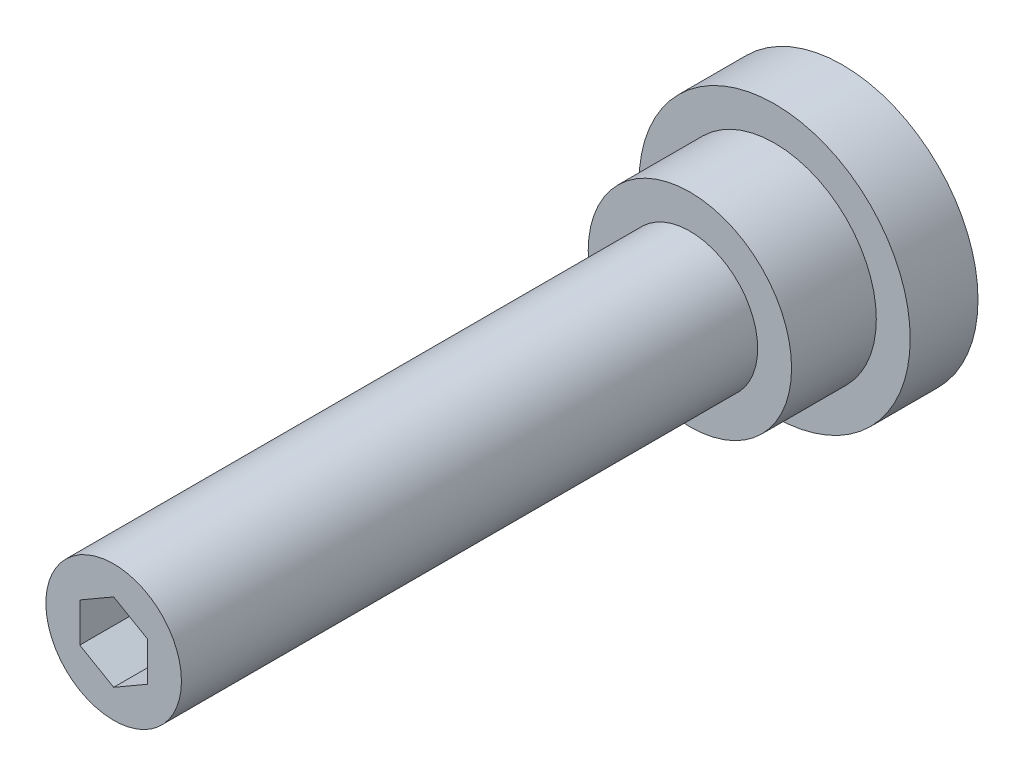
ISO-10303-21;
HEADER;
FILE_DESCRIPTION(('STEP AP214'),'2;1');
FILE_NAME('part.step','',(''),(''),'','','');
FILE_SCHEMA(('AUTOMOTIVE_DESIGN { 1 0 10303 214 1 1 1 1 }'));
ENDSEC;
DATA;
#1=APPLICATION_CONTEXT('core data for automotive mechanical design processes');
#2=APPLICATION_PROTOCOL_DEFINITION('international standard','automotive_design',2000,#1);
#3=PRODUCT_CONTEXT('',#1,'mechanical');
#4=PRODUCT('Part','Part','',(#3));
#5=PRODUCT_RELATED_PRODUCT_CATEGORY('part','',(#4));
#6=PRODUCT_DEFINITION_FORMATION('','',#4);
#7=PRODUCT_DEFINITION_CONTEXT('part definition',#1,'design');
#8=PRODUCT_DEFINITION('design','',#6,#7);
#9=PRODUCT_DEFINITION_SHAPE('','',#8);
#10=(LENGTH_UNIT() NAMED_UNIT(*) SI_UNIT(.MILLI.,.METRE.));
#11=(NAMED_UNIT(*) PLANE_ANGLE_UNIT() SI_UNIT($,.RADIAN.));
#12=(NAMED_UNIT(*) SI_UNIT($,.STERADIAN.) SOLID_ANGLE_UNIT());
#13=UNCERTAINTY_MEASURE_WITH_UNIT(LENGTH_MEASURE(1.E-05),#10,'distance_accuracy_value','');
#14=(GEOMETRIC_REPRESENTATION_CONTEXT(3) GLOBAL_UNCERTAINTY_ASSIGNED_CONTEXT((#13)) GLOBAL_UNIT_ASSIGNED_CONTEXT((#10,
#11,#12)) REPRESENTATION_CONTEXT('',''));
#15=CARTESIAN_POINT('',(0.,0.,0.));
#16=DIRECTION('',(0.,0.,1.));
#17=DIRECTION('',(1.,0.,0.));
#18=AXIS2_PLACEMENT_3D('',#15,#16,#17);
#19=CARTESIAN_POINT('',(0.,0.,43.));
#20=DIRECTION('',(0.,0.,1.));
#21=DIRECTION('',(1.,0.,0.));
#22=AXIS2_PLACEMENT_3D('',#19,#20,#21);
#23=PLANE('',#22);
#24=DIRECTION('',(-0.866025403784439,0.5,0.));
#25=VECTOR('',#24,1.);
#26=CARTESIAN_POINT('',(2.,1.15470053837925,43.));
#27=LINE('',#26,#25);
#28=CARTESIAN_POINT('',(2.,1.15470053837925,43.));
#29=VERTEX_POINT('',#28);
#30=CARTESIAN_POINT('',(0.,2.30940107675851,43.));
#31=VERTEX_POINT('',#30);
#32=EDGE_CURVE('E28',#29,#31,#27,.T.);
#33=ORIENTED_EDGE('',*,*,#32,.F.);
#34=DIRECTION('',(0.,1.,0.));
#35=VECTOR('',#34,1.);
#36=CARTESIAN_POINT('',(2.,-1.15470053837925,43.));
#37=LINE('',#36,#35);
#38=CARTESIAN_POINT('',(2.,-1.15470053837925,43.));
#39=VERTEX_POINT('',#38);
#40=EDGE_CURVE('E111',#39,#29,#37,.T.);
#41=ORIENTED_EDGE('',*,*,#40,.F.);
#42=DIRECTION('',(0.866025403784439,0.5,0.));
#43=VECTOR('',#42,1.);
#44=CARTESIAN_POINT('',(0.,-2.30940107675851,43.));
#45=LINE('',#44,#43);
#46=CARTESIAN_POINT('',(0.,-2.30940107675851,43.));
#47=VERTEX_POINT('',#46);
#48=EDGE_CURVE('E109',#47,#39,#45,.T.);
#49=ORIENTED_EDGE('',*,*,#48,.F.);
#50=DIRECTION('',(0.866025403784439,-0.5,0.));
#51=VECTOR('',#50,1.);
#52=CARTESIAN_POINT('',(-2.,-1.15470053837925,43.));
#53=LINE('',#52,#51);
#54=CARTESIAN_POINT('',(-2.,-1.15470053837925,43.));
#55=VERTEX_POINT('',#54);
#56=EDGE_CURVE('E76',#55,#47,#53,.T.);
#57=ORIENTED_EDGE('',*,*,#56,.F.);
#58=DIRECTION('',(0.,-1.,0.));
#59=VECTOR('',#58,1.);
#60=CARTESIAN_POINT('',(-2.,1.15470053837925,43.));
#61=LINE('',#60,#59);
#62=CARTESIAN_POINT('',(-2.,1.15470053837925,43.));
#63=VERTEX_POINT('',#62);
#64=EDGE_CURVE('E105',#63,#55,#61,.T.);
#65=ORIENTED_EDGE('',*,*,#64,.F.);
#66=DIRECTION('',(-0.866025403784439,-0.5,0.));
#67=VECTOR('',#66,1.);
#68=CARTESIAN_POINT('',(0.,2.30940107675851,43.));
#69=LINE('',#68,#67);
#70=EDGE_CURVE('E102',#31,#63,#69,.T.);
#71=ORIENTED_EDGE('',*,*,#70,.F.);
#72=EDGE_LOOP('',(#33,#41,#49,#57,#65,#71));
#73=FACE_BOUND('',#72,.T.);
#74=CARTESIAN_POINT('',(0.,0.,43.));
#75=DIRECTION('',(0.,0.,1.));
#76=DIRECTION('',(1.,0.,0.));
#77=AXIS2_PLACEMENT_3D('',#74,#75,#76);
#78=CIRCLE('',#77,4.);
#79=CARTESIAN_POINT('',(4.,0.,43.));
#80=VERTEX_POINT('',#79);
#81=EDGE_CURVE('E9',#80,#80,#78,.T.);
#82=ORIENTED_EDGE('',*,*,#81,.T.);
#83=EDGE_LOOP('',(#82));
#84=FACE_BOUND('',#83,.T.);
#85=ADVANCED_FACE('F14',(#73,#84),#23,.T.);
#86=CARTESIAN_POINT('',(0.,0.,30.));
#87=DIRECTION('',(0.,0.,1.));
#88=DIRECTION('',(1.,0.,0.));
#89=AXIS2_PLACEMENT_3D('',#86,#87,#88);
#90=CYLINDRICAL_SURFACE('',#89,4.);
#91=CARTESIAN_POINT('',(0.,0.,9.));
#92=DIRECTION('',(0.,0.,1.));
#93=DIRECTION('',(1.,0.,0.));
#94=AXIS2_PLACEMENT_3D('',#91,#92,#93);
#95=CIRCLE('',#94,4.);
#96=CARTESIAN_POINT('',(4.,0.,9.));
#97=VERTEX_POINT('',#96);
#98=EDGE_CURVE('E21',#97,#97,#95,.T.);
#99=ORIENTED_EDGE('',*,*,#98,.T.);
#100=EDGE_LOOP('',(#99));
#101=FACE_BOUND('',#100,.T.);
#102=ORIENTED_EDGE('',*,*,#81,.F.);
#103=EDGE_LOOP('',(#102));
#104=FACE_BOUND('',#103,.T.);
#105=ADVANCED_FACE('F134',(#101,#104),#90,.T.);
#106=CARTESIAN_POINT('',(-4.,0.,9.));
#107=DIRECTION('',(0.,0.,1.));
#108=DIRECTION('',(1.,0.,0.));
#109=AXIS2_PLACEMENT_3D('',#106,#107,#108);
#110=PLANE('',#109);
#111=CARTESIAN_POINT('',(0.,0.,9.));
#112=DIRECTION('',(0.,0.,1.));
#113=DIRECTION('',(1.,0.,0.));
#114=AXIS2_PLACEMENT_3D('',#111,#112,#113);
#115=CIRCLE('',#114,6.);
#116=CARTESIAN_POINT('',(6.,0.,9.));
#117=VERTEX_POINT('',#116);
#118=EDGE_CURVE('E129',#117,#117,#115,.T.);
#119=ORIENTED_EDGE('',*,*,#118,.T.);
#120=EDGE_LOOP('',(#119));
#121=FACE_BOUND('',#120,.T.);
#122=ORIENTED_EDGE('',*,*,#98,.F.);
#123=EDGE_LOOP('',(#122));
#124=FACE_BOUND('',#123,.T.);
#125=ADVANCED_FACE('F137',(#121,#124),#110,.T.);
#126=CARTESIAN_POINT('',(0.,0.,30.));
#127=DIRECTION('',(0.,0.,1.));
#128=DIRECTION('',(1.,0.,0.));
#129=AXIS2_PLACEMENT_3D('',#126,#127,#128);
#130=CYLINDRICAL_SURFACE('',#129,6.);
#131=CARTESIAN_POINT('',(0.,0.,4.));
#132=DIRECTION('',(0.,0.,1.));
#133=DIRECTION('',(1.,0.,0.));
#134=AXIS2_PLACEMENT_3D('',#131,#132,#133);
#135=CIRCLE('',#134,6.);
#136=CARTESIAN_POINT('',(6.,0.,4.));
#137=VERTEX_POINT('',#136);
#138=EDGE_CURVE('E126',#137,#137,#135,.T.);
#139=ORIENTED_EDGE('',*,*,#138,.T.);
#140=EDGE_LOOP('',(#139));
#141=FACE_BOUND('',#140,.T.);
#142=ORIENTED_EDGE('',*,*,#118,.F.);
#143=EDGE_LOOP('',(#142));
#144=FACE_BOUND('',#143,.T.);
#145=ADVANCED_FACE('F139',(#141,#144),#130,.T.);
#146=CARTESIAN_POINT('',(-6.,0.,4.));
#147=DIRECTION('',(0.,0.,1.));
#148=DIRECTION('',(1.,0.,0.));
#149=AXIS2_PLACEMENT_3D('',#146,#147,#148);
#150=PLANE('',#149);
#151=CARTESIAN_POINT('',(0.,0.,4.));
#152=DIRECTION('',(0.,0.,1.));
#153=DIRECTION('',(1.,0.,0.));
#154=AXIS2_PLACEMENT_3D('',#151,#152,#153);
#155=CIRCLE('',#154,8.);
#156=CARTESIAN_POINT('',(8.,0.,4.));
#157=VERTEX_POINT('',#156);
#158=EDGE_CURVE('E123',#157,#157,#155,.T.);
#159=ORIENTED_EDGE('',*,*,#158,.T.);
#160=EDGE_LOOP('',(#159));
#161=FACE_BOUND('',#160,.T.);
#162=ORIENTED_EDGE('',*,*,#138,.F.);
#163=EDGE_LOOP('',(#162));
#164=FACE_BOUND('',#163,.T.);
#165=ADVANCED_FACE('F147',(#161,#164),#150,.T.);
#166=CARTESIAN_POINT('',(0.,0.,30.));
#167=DIRECTION('',(0.,0.,1.));
#168=DIRECTION('',(1.,0.,0.));
#169=AXIS2_PLACEMENT_3D('',#166,#167,#168);
#170=CYLINDRICAL_SURFACE('',#169,8.);
#171=CARTESIAN_POINT('',(0.,0.,0.));
#172=DIRECTION('',(0.,0.,1.));
#173=DIRECTION('',(1.,0.,0.));
#174=AXIS2_PLACEMENT_3D('',#171,#172,#173);
#175=CIRCLE('',#174,8.);
#176=CARTESIAN_POINT('',(8.,0.,0.));
#177=VERTEX_POINT('',#176);
#178=EDGE_CURVE('E115',#177,#177,#175,.T.);
#179=ORIENTED_EDGE('',*,*,#178,.T.);
#180=EDGE_LOOP('',(#179));
#181=FACE_BOUND('',#180,.T.);
#182=ORIENTED_EDGE('',*,*,#158,.F.);
#183=EDGE_LOOP('',(#182));
#184=FACE_BOUND('',#183,.T.);
#185=ADVANCED_FACE('F172',(#181,#184),#170,.T.);
#186=CARTESIAN_POINT('',(-8.,0.,0.));
#187=DIRECTION('',(0.,0.,-1.));
#188=DIRECTION('',(-1.,0.,0.));
#189=AXIS2_PLACEMENT_3D('',#186,#187,#188);
#190=PLANE('',#189);
#191=ORIENTED_EDGE('',*,*,#178,.F.);
#192=EDGE_LOOP('',(#191));
#193=FACE_BOUND('',#192,.T.);
#194=ADVANCED_FACE('F165',(#193),#190,.T.);
#195=CARTESIAN_POINT('',(2.,1.15470053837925,39.));
#196=DIRECTION('',(0.5,0.866025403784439,0.));
#197=DIRECTION('',(-0.866025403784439,0.5,0.));
#198=AXIS2_PLACEMENT_3D('',#195,#196,#197);
#199=PLANE('',#198);
#200=ORIENTED_EDGE('',*,*,#32,.T.);
#201=DIRECTION('',(0.,0.,1.));
#202=VECTOR('',#201,1.);
#203=CARTESIAN_POINT('',(0.,2.30940107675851,39.));
#204=LINE('',#203,#202);
#205=CARTESIAN_POINT('',(0.,2.30940107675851,39.));
#206=VERTEX_POINT('',#205);
#207=EDGE_CURVE('E58',#206,#31,#204,.T.);
#208=ORIENTED_EDGE('',*,*,#207,.F.);
#209=DIRECTION('',(-0.866025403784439,0.5,0.));
#210=VECTOR('',#209,1.);
#211=CARTESIAN_POINT('',(2.,1.15470053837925,39.));
#212=LINE('',#211,#210);
#213=CARTESIAN_POINT('',(2.,1.15470053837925,39.));
#214=VERTEX_POINT('',#213);
#215=EDGE_CURVE('E113',#214,#206,#212,.T.);
#216=ORIENTED_EDGE('',*,*,#215,.F.);
#217=DIRECTION('',(0.,0.,1.));
#218=VECTOR('',#217,1.);
#219=CARTESIAN_POINT('',(2.,1.15470053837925,39.));
#220=LINE('',#219,#218);
#221=EDGE_CURVE('E36',#214,#29,#220,.T.);
#222=ORIENTED_EDGE('',*,*,#221,.T.);
#223=EDGE_LOOP('',(#200,#208,#216,#222));
#224=FACE_BOUND('',#223,.T.);
#225=ADVANCED_FACE('F162',(#224),#199,.F.);
#226=CARTESIAN_POINT('',(2.,-1.15470053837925,39.));
#227=DIRECTION('',(1.,0.,0.));
#228=DIRECTION('',(0.,0.,-1.));
#229=AXIS2_PLACEMENT_3D('',#226,#227,#228);
#230=PLANE('',#229);
#231=ORIENTED_EDGE('',*,*,#40,.T.);
#232=ORIENTED_EDGE('',*,*,#221,.F.);
#233=DIRECTION('',(0.,1.,0.));
#234=VECTOR('',#233,1.);
#235=CARTESIAN_POINT('',(2.,-1.15470053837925,39.));
#236=LINE('',#235,#234);
#237=CARTESIAN_POINT('',(2.,-1.15470053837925,39.));
#238=VERTEX_POINT('',#237);
#239=EDGE_CURVE('E88',#238,#214,#236,.T.);
#240=ORIENTED_EDGE('',*,*,#239,.F.);
#241=DIRECTION('',(0.,0.,1.));
#242=VECTOR('',#241,1.);
#243=CARTESIAN_POINT('',(2.,-1.15470053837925,39.));
#244=LINE('',#243,#242);
#245=EDGE_CURVE('E80',#238,#39,#244,.T.);
#246=ORIENTED_EDGE('',*,*,#245,.T.);
#247=EDGE_LOOP('',(#231,#232,#240,#246));
#248=FACE_BOUND('',#247,.T.);
#249=ADVANCED_FACE('F164',(#248),#230,.F.);
#250=CARTESIAN_POINT('',(0.,-2.30940107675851,39.));
#251=DIRECTION('',(0.5,-0.866025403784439,0.));
#252=DIRECTION('',(0.866025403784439,0.5,0.));
#253=AXIS2_PLACEMENT_3D('',#250,#251,#252);
#254=PLANE('',#253);
#255=ORIENTED_EDGE('',*,*,#48,.T.);
#256=ORIENTED_EDGE('',*,*,#245,.F.);
#257=DIRECTION('',(0.866025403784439,0.5,0.));
#258=VECTOR('',#257,1.);
#259=CARTESIAN_POINT('',(0.,-2.30940107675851,39.));
#260=LINE('',#259,#258);
#261=CARTESIAN_POINT('',(0.,-2.30940107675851,39.));
#262=VERTEX_POINT('',#261);
#263=EDGE_CURVE('E84',#262,#238,#260,.T.);
#264=ORIENTED_EDGE('',*,*,#263,.F.);
#265=DIRECTION('',(0.,0.,1.));
#266=VECTOR('',#265,1.);
#267=CARTESIAN_POINT('',(0.,-2.30940107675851,39.));
#268=LINE('',#267,#266);
#269=EDGE_CURVE('E69',#262,#47,#268,.T.);
#270=ORIENTED_EDGE('',*,*,#269,.T.);
#271=EDGE_LOOP('',(#255,#256,#264,#270));
#272=FACE_BOUND('',#271,.T.);
#273=ADVANCED_FACE('F85',(#272),#254,.F.);
#274=CARTESIAN_POINT('',(-2.,-1.15470053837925,39.));
#275=DIRECTION('',(-0.5,-0.866025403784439,0.));
#276=DIRECTION('',(0.866025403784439,-0.5,0.));
#277=AXIS2_PLACEMENT_3D('',#274,#275,#276);
#278=PLANE('',#277);
#279=ORIENTED_EDGE('',*,*,#56,.T.);
#280=ORIENTED_EDGE('',*,*,#269,.F.);
#281=DIRECTION('',(0.866025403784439,-0.5,0.));
#282=VECTOR('',#281,1.);
#283=CARTESIAN_POINT('',(-2.,-1.15470053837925,39.));
#284=LINE('',#283,#282);
#285=CARTESIAN_POINT('',(-2.,-1.15470053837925,39.));
#286=VERTEX_POINT('',#285);
#287=EDGE_CURVE('E73',#286,#262,#284,.T.);
#288=ORIENTED_EDGE('',*,*,#287,.F.);
#289=DIRECTION('',(0.,0.,1.));
#290=VECTOR('',#289,1.);
#291=CARTESIAN_POINT('',(-2.,-1.15470053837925,39.));
#292=LINE('',#291,#290);
#293=EDGE_CURVE('E81',#286,#55,#292,.T.);
#294=ORIENTED_EDGE('',*,*,#293,.T.);
#295=EDGE_LOOP('',(#279,#280,#288,#294));
#296=FACE_BOUND('',#295,.T.);
#297=ADVANCED_FACE('F71',(#296),#278,.F.);
#298=CARTESIAN_POINT('',(-2.,1.15470053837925,39.));
#299=DIRECTION('',(-1.,0.,0.));
#300=DIRECTION('',(0.,-1.,0.));
#301=AXIS2_PLACEMENT_3D('',#298,#299,#300);
#302=PLANE('',#301);
#303=ORIENTED_EDGE('',*,*,#64,.T.);
#304=ORIENTED_EDGE('',*,*,#293,.F.);
#305=DIRECTION('',(0.,-1.,0.));
#306=VECTOR('',#305,1.);
#307=CARTESIAN_POINT('',(-2.,1.15470053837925,39.));
#308=LINE('',#307,#306);
#309=CARTESIAN_POINT('',(-2.,1.15470053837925,39.));
#310=VERTEX_POINT('',#309);
#311=EDGE_CURVE('E94',#310,#286,#308,.T.);
#312=ORIENTED_EDGE('',*,*,#311,.F.);
#313=DIRECTION('',(0.,0.,1.));
#314=VECTOR('',#313,1.);
#315=CARTESIAN_POINT('',(-2.,1.15470053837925,39.));
#316=LINE('',#315,#314);
#317=EDGE_CURVE('E118',#310,#63,#316,.T.);
#318=ORIENTED_EDGE('',*,*,#317,.T.);
#319=EDGE_LOOP('',(#303,#304,#312,#318));
#320=FACE_BOUND('',#319,.T.);
#321=ADVANCED_FACE('F237',(#320),#302,.F.);
#322=CARTESIAN_POINT('',(0.,2.30940107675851,39.));
#323=DIRECTION('',(-0.5,0.866025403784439,0.));
#324=DIRECTION('',(-0.866025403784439,-0.5,0.));
#325=AXIS2_PLACEMENT_3D('',#322,#323,#324);
#326=PLANE('',#325);
#327=ORIENTED_EDGE('',*,*,#70,.T.);
#328=ORIENTED_EDGE('',*,*,#317,.F.);
#329=DIRECTION('',(-0.866025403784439,-0.5,0.));
#330=VECTOR('',#329,1.);
#331=CARTESIAN_POINT('',(0.,2.30940107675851,39.));
#332=LINE('',#331,#330);
#333=EDGE_CURVE('E96',#206,#310,#332,.T.);
#334=ORIENTED_EDGE('',*,*,#333,.F.);
#335=ORIENTED_EDGE('',*,*,#207,.T.);
#336=EDGE_LOOP('',(#327,#328,#334,#335));
#337=FACE_BOUND('',#336,.T.);
#338=ADVANCED_FACE('F160',(#337),#326,.F.);
#339=CARTESIAN_POINT('',(0.,2.30940107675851,39.));
#340=DIRECTION('',(0.,0.,1.));
#341=DIRECTION('',(1.,0.,0.));
#342=AXIS2_PLACEMENT_3D('',#339,#340,#341);
#343=PLANE('',#342);
#344=ORIENTED_EDGE('',*,*,#215,.T.);
#345=ORIENTED_EDGE('',*,*,#333,.T.);
#346=ORIENTED_EDGE('',*,*,#311,.T.);
#347=ORIENTED_EDGE('',*,*,#287,.T.);
#348=ORIENTED_EDGE('',*,*,#263,.T.);
#349=ORIENTED_EDGE('',*,*,#239,.T.);
#350=EDGE_LOOP('',(#344,#345,#346,#347,#348,#349));
#351=FACE_BOUND('',#350,.T.);
#352=ADVANCED_FACE('F91',(#351),#343,.T.);
#353=CLOSED_SHELL('',(#85,#105,#125,#145,#165,#185,#194,#225,#249,#273,#297,#321,#338,#352));
#354=MANIFOLD_SOLID_BREP('B1',#353);
#355=ADVANCED_BREP_SHAPE_REPRESENTATION('',(#18,#354),#14);
#356=SHAPE_DEFINITION_REPRESENTATION(#9,#355);
ENDSEC;
END-ISO-10303-21;
